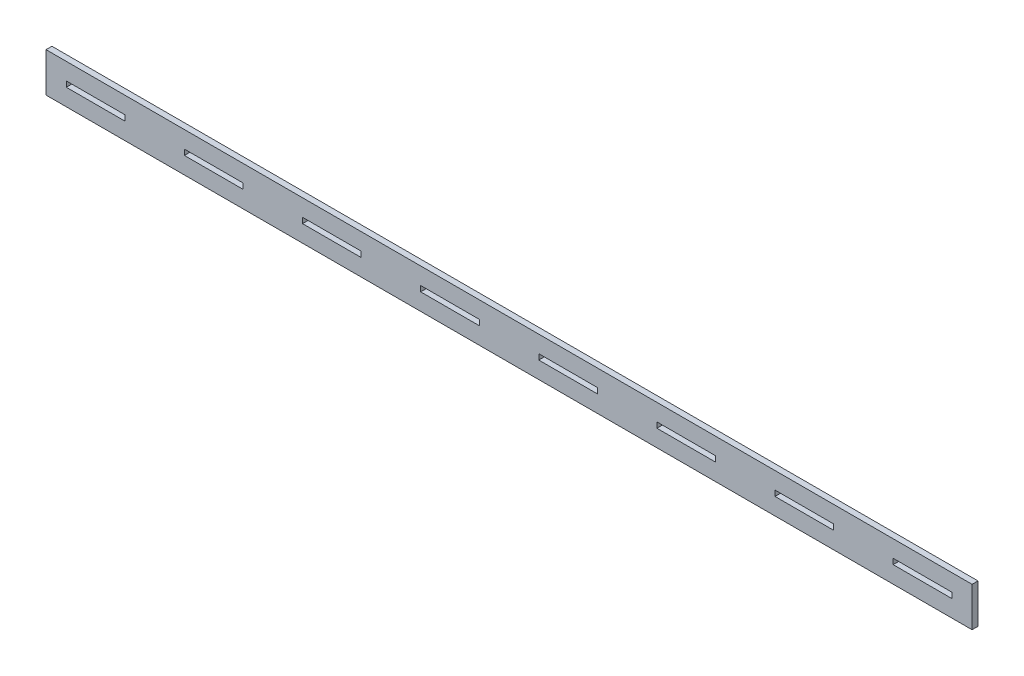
from build123d import *

# Parameters (mm, degrees)
CROQUIS1_W              = 470.4
CROQUIS1_H              = 20
CROQUIS1_W_2            = 29.8
CROQUIS1_H_2            = 2.8
SALIENTE_EXTRUIR1_DEPTH = 3


with BuildPart() as part:
    # Croquis1 → Saliente-Extruir1 (new body)
    with BuildSketch(Plane.XY):
        Rectangle(CROQUIS1_W, CROQUIS1_H)
        with Locations((-210, 0)):
            Rectangle(CROQUIS1_W_2, CROQUIS1_H_2, mode=Mode.SUBTRACT)
        with Locations((-30, 0)):
            Rectangle(CROQUIS1_W_2, CROQUIS1_H_2, mode=Mode.SUBTRACT)
        with Locations((-90, 0)):
            Rectangle(CROQUIS1_W_2, CROQUIS1_H_2, mode=Mode.SUBTRACT)
        with Locations((-150, 0)):
            Rectangle(CROQUIS1_W_2, CROQUIS1_H_2, mode=Mode.SUBTRACT)
        with Locations((30, 0)):
            Rectangle(CROQUIS1_W_2, CROQUIS1_H_2, mode=Mode.SUBTRACT)
        with Locations((90, 0)):
            Rectangle(CROQUIS1_W_2, CROQUIS1_H_2, mode=Mode.SUBTRACT)
        with Locations((150, 0)):
            Rectangle(CROQUIS1_W_2, CROQUIS1_H_2, mode=Mode.SUBTRACT)
        with Locations((210, 0)):
            Rectangle(CROQUIS1_W_2, CROQUIS1_H_2, mode=Mode.SUBTRACT)
    extrude(amount=SALIENTE_EXTRUIR1_DEPTH)


solid = part.part
